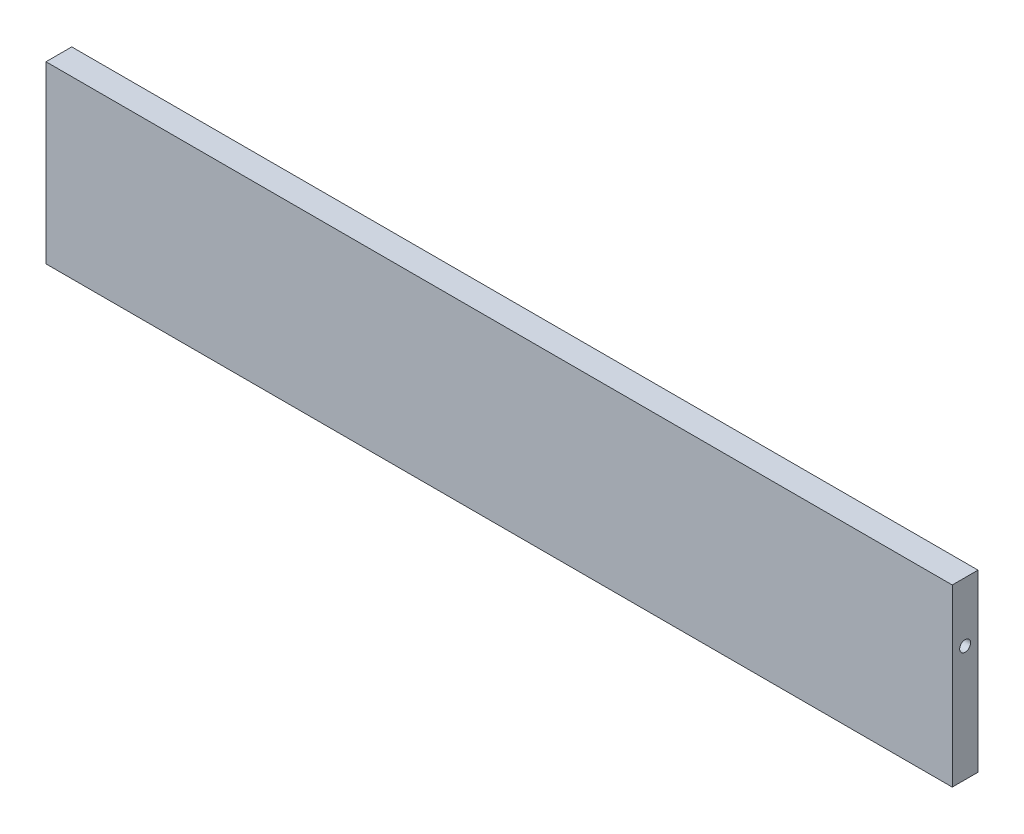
from build123d import *

# Parameters (mm, degrees)
SKETCH1_W                 = 223.52
SKETCH1_H                 = 43.18
BOSS_EXTRUDE1_DEPTH       = 6.35
F_6_32_TAPPED_HOLE2_D     = 2.7051
F_6_32_TAPPED_HOLE2_DEPTH = 9.398
F_6_32_TAPPED_HOLE2_TIP   = 0.81269403


with BuildPart() as part:
    # Sketch1 → Boss-Extrude1 (new body)
    with BuildSketch(Plane.XY):
        Rectangle(SKETCH1_W, SKETCH1_H)
    extrude(amount=BOSS_EXTRUDE1_DEPTH)

    # Sketch2 → 6-32 Tapped Hole1 (revolve, cut)
    with BuildSketch(Plane(origin=(111.76, 6.985, 3.175), x_dir=(0, 0, -1), z_dir=(0, 1, 0))):
        Polygon((0, 0), (0, 10.21069403), (1.35255, 9.398), (1.35255, 0), align=None)
    f_6_32_tapped_hole1 = revolve(axis=Axis((118.11, 6.985, 3.175), (-1, 0, 0)), mode=Mode.SUBTRACT)

    # Mirror1: 6-32 Tapped Hole1 across plane
    add(f_6_32_tapped_hole1.mirror(Plane(origin=(0, 0, 0), x_dir=(0, 0, 1), z_dir=(1, 0, 0))), mode=Mode.SUBTRACT)

    # 6-32 Tapped Hole2
    with Locations(Plane(origin=(0, -21.59, 0), x_dir=(-1, 0, 0), z_dir=(0, -1, 0))):
        with Locations((0, -3.175)):
            Hole(F_6_32_TAPPED_HOLE2_D / 2, depth=F_6_32_TAPPED_HOLE2_DEPTH)
            with Locations((0, 0, -(F_6_32_TAPPED_HOLE2_DEPTH + F_6_32_TAPPED_HOLE2_TIP / 2))):  # 118° drill point
                Cone(0, F_6_32_TAPPED_HOLE2_D / 2, F_6_32_TAPPED_HOLE2_TIP, mode=Mode.SUBTRACT)


solid = part.part
